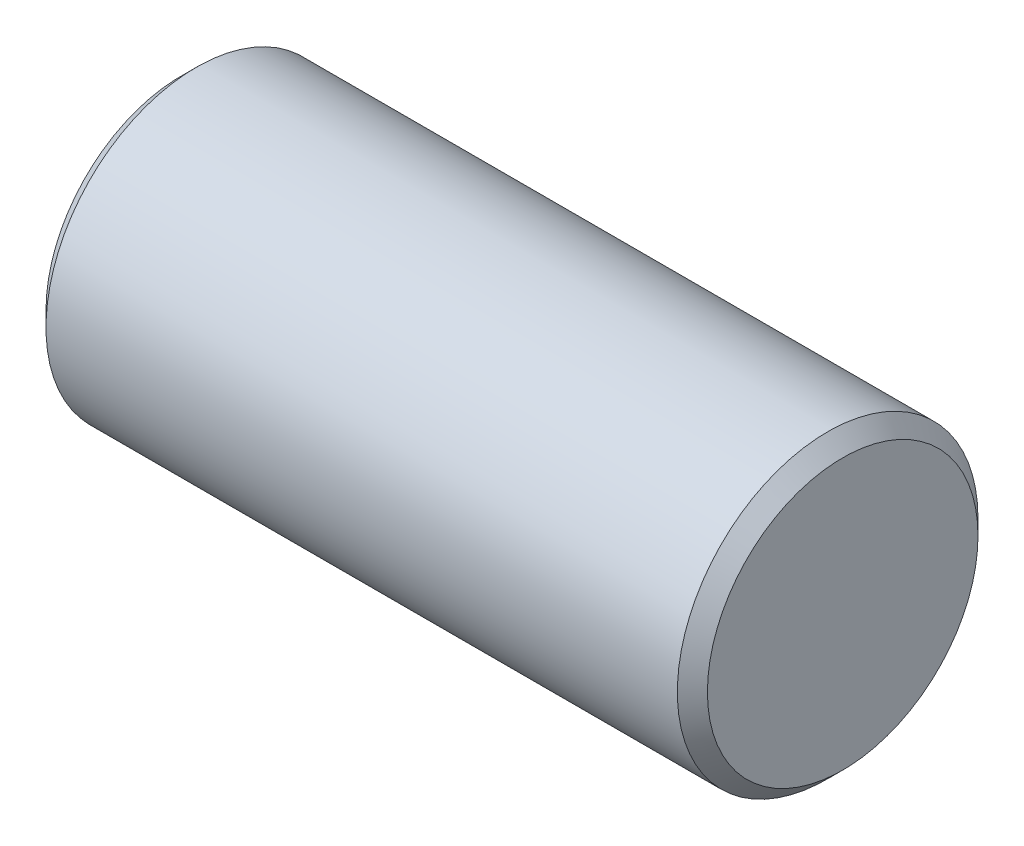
from build123d import *

# Parameters (mm, degrees)
ESQUISSE1_R      = 5
EXTRUSION1_DEPTH = 11
CHANFREIN1_SIZE  = 0.5


with BuildPart() as part:
    # Esquisse1 → Extrusion1 (new, symmetric)
    with BuildSketch(Plane(origin=(0, 0, 0), x_dir=(0, 0, -1), z_dir=(1, 0, 0))):
        Circle(ESQUISSE1_R)
    extrude(amount=EXTRUSION1_DEPTH, both=True)

    # Chanfrein1
    chanfrein1_edges = [part.edges().sort_by_distance(p)[0] for p in [
        (-11, 0, 5),
        (11, 0, 5),
    ]]
    chamfer(chanfrein1_edges, length=CHANFREIN1_SIZE)


solid = part.part
